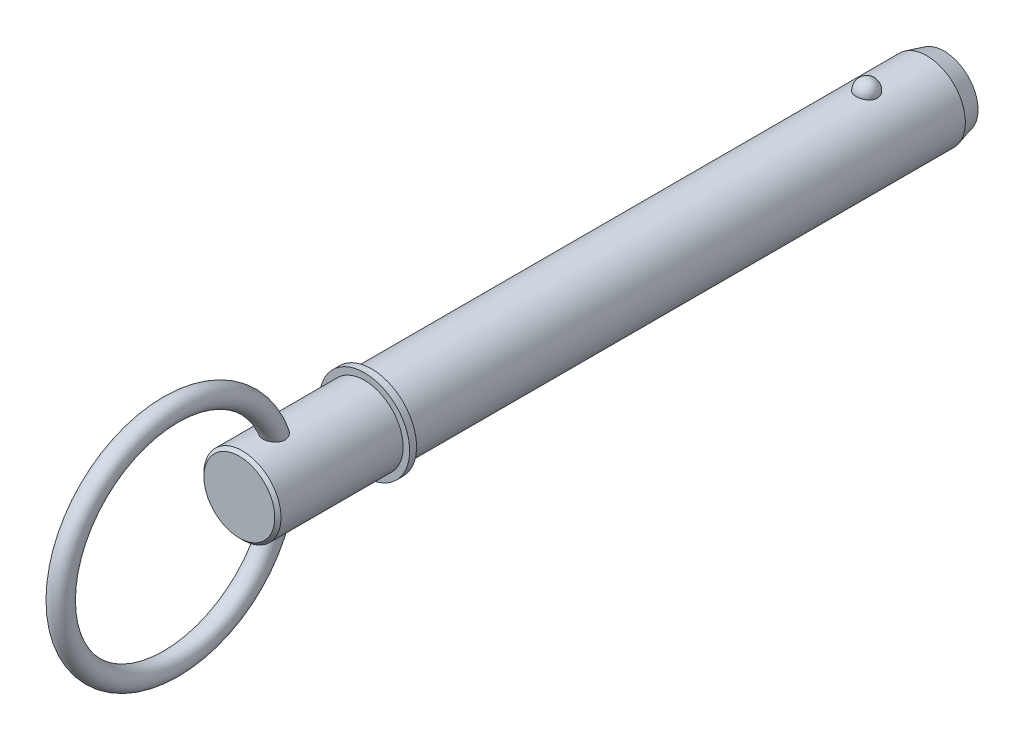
from build123d import *

# Parameters (mm, degrees)
SKETCH2_R           = 11.115
BOSS_EXTRUDE1_DEPTH = 139.7
BOSS_EXTRUDE2_START = 25.4
SKETCH3_R           = 11.115
BOSS_EXTRUDE2_DEPTH = 25.4
CHAMFER1_SIZE       = 5
CHAMFER1_SIZE2      = 1.339745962
SKETCH20_W          = 2
SKETCH20_H          = 13
SKETCH21_R          = 11.115
BOSS_EXTRUDE3_DEPTH = 38.1
CHAMFER2_SIZE       = 0.9
SKETCH24_R          = 3


with BuildPart() as part:
    # Sketch2 → Boss-Extrude1 (new body)
    with BuildSketch(Plane.XY):
        Circle(SKETCH2_R)
    extrude(amount=BOSS_EXTRUDE1_DEPTH)

    # Sketch3 → Boss-Extrude2 (add)
    with BuildSketch(Plane(origin=(0, 0, 0), x_dir=(-1, 0, 0), z_dir=(0, 0, -1)).offset(BOSS_EXTRUDE2_START)):
        Circle(SKETCH3_R)
    extrude(amount=-BOSS_EXTRUDE2_DEPTH)

    # Chamfer1
    chamfer1_edges = [part.edges().sort_by_distance(p)[0] for p in [
        (11.115, 0, -25.4),
    ]]
    chamfer1_side = [part.faces().sort_by_distance(p)[0] for p in [
        (11.115, 0, -12.7),
    ]]
    chamfer(chamfer1_edges, length=CHAMFER1_SIZE, length2=CHAMFER1_SIZE2, reference=chamfer1_side[0])

    # Sketch18 → Revolve1 (revolve)
    with BuildSketch(Plane(origin=(0, 0, 0), x_dir=(0, 0, -1), z_dir=(1, 0, 0))):
        with BuildLine():
            Line((3.07, 14.185), (3.07, 8.045))
            ThreePointArc((3.07, 8.045), (0, 11.115), (3.07, 14.185))
        make_face()
    revolve(axis=Axis((0, 14.185, -3.07), (0, -1, 0)))

    # Sketch20 → Revolve2 (revolve)
    with BuildSketch(Plane(origin=(0, 0, 0), x_dir=(0, 0, -1), z_dir=(1, 0, 0)), mode=Mode.PRIVATE) as revolve2_sk:
        with Locations((-140.7, 6.5)):
            Rectangle(SKETCH20_W, SKETCH20_H)
    revolve(revolve2_sk.sketch.rotate(Axis((0, 0, 33.728787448), (0, 0, 1)), 90), axis=Axis((0, 0, 33.728787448), (0, 0, 1)))

    # Sketch21 → Boss-Extrude3 (add)
    with BuildSketch(Plane(origin=(0, 0, 139.7), x_dir=(-1, 0, 0), z_dir=(0, 0, -1))):
        Circle(SKETCH21_R)
    extrude(amount=-BOSS_EXTRUDE3_DEPTH)

    # Chamfer2
    chamfer2_edges = [part.edges().sort_by_distance(p)[0] for p in [
        (11.115, 0, 177.8),
    ]]
    chamfer(chamfer2_edges, length=CHAMFER2_SIZE)

    # Sweep1: sweep along a path in Sketch23
    with BuildLine(Plane(origin=(0, 0, 0), x_dir=(0, 0, -1), z_dir=(1, 0, 0))) as sweep1_path:
        CenterArc((-197.55, 0), 31.75, 0, 360)
    # Sketch24 → Sweep1 (sweep)
    with BuildSketch(Plane(origin=(0, 0, 0), x_dir=(1, 0, 0), z_dir=(0, 1, 0))):
        with Locations((0, -165.8)):
            Circle(SKETCH24_R)
    sweep(path=sweep1_path.line)


solid = part.part
